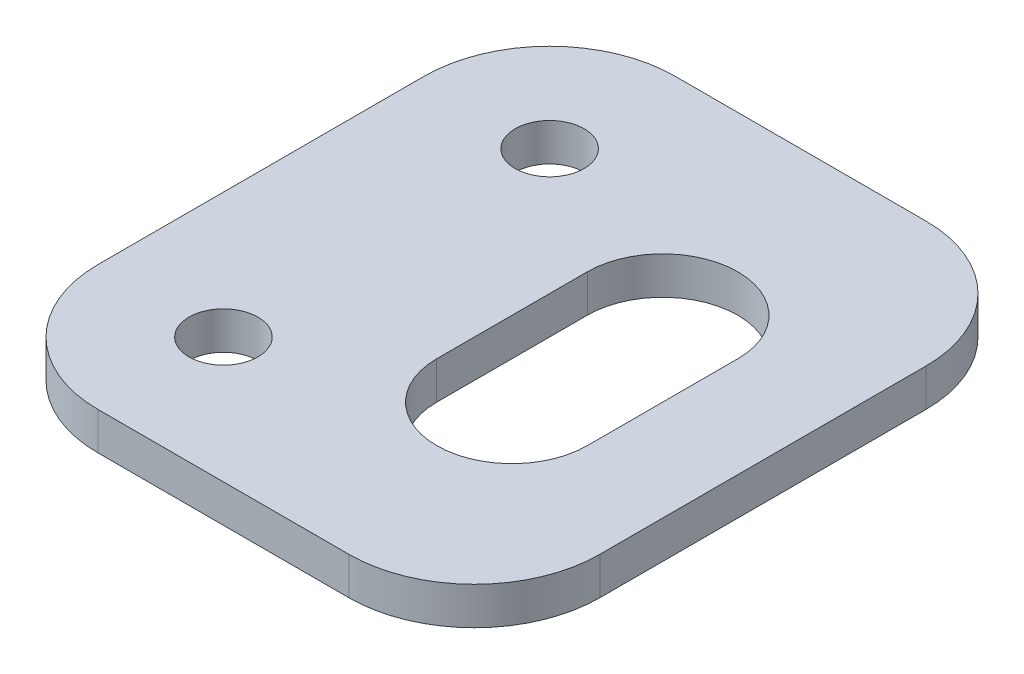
ISO-10303-21;
HEADER;
FILE_DESCRIPTION(('STEP AP214'),'2;1');
FILE_NAME('part.step','',(''),(''),'','','');
FILE_SCHEMA(('AUTOMOTIVE_DESIGN { 1 0 10303 214 1 1 1 1 }'));
ENDSEC;
DATA;
#1=APPLICATION_CONTEXT('core data for automotive mechanical design processes');
#2=APPLICATION_PROTOCOL_DEFINITION('international standard','automotive_design',2000,#1);
#3=PRODUCT_CONTEXT('',#1,'mechanical');
#4=PRODUCT('Part','Part','',(#3));
#5=PRODUCT_RELATED_PRODUCT_CATEGORY('part','',(#4));
#6=PRODUCT_DEFINITION_FORMATION('','',#4);
#7=PRODUCT_DEFINITION_CONTEXT('part definition',#1,'design');
#8=PRODUCT_DEFINITION('design','',#6,#7);
#9=PRODUCT_DEFINITION_SHAPE('','',#8);
#10=(LENGTH_UNIT() NAMED_UNIT(*) SI_UNIT(.MILLI.,.METRE.));
#11=(NAMED_UNIT(*) PLANE_ANGLE_UNIT() SI_UNIT($,.RADIAN.));
#12=(NAMED_UNIT(*) SI_UNIT($,.STERADIAN.) SOLID_ANGLE_UNIT());
#13=UNCERTAINTY_MEASURE_WITH_UNIT(LENGTH_MEASURE(1.E-05),#10,'distance_accuracy_value','');
#14=(GEOMETRIC_REPRESENTATION_CONTEXT(3) GLOBAL_UNCERTAINTY_ASSIGNED_CONTEXT((#13)) GLOBAL_UNIT_ASSIGNED_CONTEXT((#10,
#11,#12)) REPRESENTATION_CONTEXT('',''));
#15=CARTESIAN_POINT('',(0.,0.,0.));
#16=DIRECTION('',(0.,0.,1.));
#17=DIRECTION('',(1.,0.,0.));
#18=AXIS2_PLACEMENT_3D('',#15,#16,#17);
#19=CARTESIAN_POINT('',(30.,3.,-36.));
#20=DIRECTION('',(0.,1.,0.));
#21=DIRECTION('',(0.,0.,1.));
#22=AXIS2_PLACEMENT_3D('',#19,#20,#21);
#23=PLANE('',#22);
#24=CARTESIAN_POINT('',(10.,3.,-10.));
#25=DIRECTION('',(0.,1.,0.));
#26=DIRECTION('',(0.,0.,1.));
#27=AXIS2_PLACEMENT_3D('',#24,#25,#26);
#28=CIRCLE('',#27,2.75);
#29=CARTESIAN_POINT('',(10.,3.,-7.25));
#30=VERTEX_POINT('',#29);
#31=EDGE_CURVE('E156',#30,#30,#28,.T.);
#32=ORIENTED_EDGE('',*,*,#31,.F.);
#33=EDGE_LOOP('',(#32));
#34=FACE_BOUND('',#33,.T.);
#35=CARTESIAN_POINT('',(30.,3.,-36.));
#36=DIRECTION('',(0.,1.,0.));
#37=DIRECTION('',(0.,0.,1.));
#38=AXIS2_PLACEMENT_3D('',#35,#36,#37);
#39=CIRCLE('',#38,10.);
#40=CARTESIAN_POINT('',(40.,3.,-35.9999999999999));
#41=VERTEX_POINT('',#40);
#42=CARTESIAN_POINT('',(29.9999999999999,3.,-46.));
#43=VERTEX_POINT('',#42);
#44=EDGE_CURVE('E168',#41,#43,#39,.T.);
#45=ORIENTED_EDGE('',*,*,#44,.T.);
#46=DIRECTION('',(-1.,0.,0.));
#47=VECTOR('',#46,1.);
#48=CARTESIAN_POINT('',(10.0000000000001,3.,-46.));
#49=LINE('',#48,#47);
#50=CARTESIAN_POINT('',(10.0000000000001,3.,-46.));
#51=VERTEX_POINT('',#50);
#52=EDGE_CURVE('E171',#43,#51,#49,.T.);
#53=ORIENTED_EDGE('',*,*,#52,.T.);
#54=CARTESIAN_POINT('',(10.,3.,-36.));
#55=DIRECTION('',(0.,1.,0.));
#56=DIRECTION('',(0.,0.,1.));
#57=AXIS2_PLACEMENT_3D('',#54,#55,#56);
#58=CIRCLE('',#57,10.);
#59=CARTESIAN_POINT('',(0.,3.,-35.9999999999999));
#60=VERTEX_POINT('',#59);
#61=EDGE_CURVE('E174',#51,#60,#58,.T.);
#62=ORIENTED_EDGE('',*,*,#61,.T.);
#63=DIRECTION('',(0.,0.,1.));
#64=VECTOR('',#63,1.);
#65=CARTESIAN_POINT('',(0.,3.,-10.0000000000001));
#66=LINE('',#65,#64);
#67=CARTESIAN_POINT('',(0.,3.,-10.0000000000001));
#68=VERTEX_POINT('',#67);
#69=EDGE_CURVE('E176',#60,#68,#66,.T.);
#70=ORIENTED_EDGE('',*,*,#69,.T.);
#71=CARTESIAN_POINT('',(10.,3.,-10.));
#72=DIRECTION('',(0.,1.,0.));
#73=DIRECTION('',(0.,0.,1.));
#74=AXIS2_PLACEMENT_3D('',#71,#72,#73);
#75=CIRCLE('',#74,10.);
#76=CARTESIAN_POINT('',(10.0000000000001,3.,0.));
#77=VERTEX_POINT('',#76);
#78=EDGE_CURVE('E178',#68,#77,#75,.T.);
#79=ORIENTED_EDGE('',*,*,#78,.T.);
#80=DIRECTION('',(1.,0.,0.));
#81=VECTOR('',#80,1.);
#82=CARTESIAN_POINT('',(10.0000000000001,3.,0.));
#83=LINE('',#82,#81);
#84=CARTESIAN_POINT('',(29.9999999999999,3.,0.));
#85=VERTEX_POINT('',#84);
#86=EDGE_CURVE('E180',#77,#85,#83,.T.);
#87=ORIENTED_EDGE('',*,*,#86,.T.);
#88=CARTESIAN_POINT('',(30.,3.,-10.));
#89=DIRECTION('',(0.,1.,0.));
#90=DIRECTION('',(0.,0.,1.));
#91=AXIS2_PLACEMENT_3D('',#88,#89,#90);
#92=CIRCLE('',#91,10.);
#93=CARTESIAN_POINT('',(40.,3.,-10.0000000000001));
#94=VERTEX_POINT('',#93);
#95=EDGE_CURVE('E182',#85,#94,#92,.T.);
#96=ORIENTED_EDGE('',*,*,#95,.T.);
#97=DIRECTION('',(0.,0.,-1.));
#98=VECTOR('',#97,1.);
#99=CARTESIAN_POINT('',(40.,3.,-10.0000000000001));
#100=LINE('',#99,#98);
#101=EDGE_CURVE('E184',#94,#41,#100,.T.);
#102=ORIENTED_EDGE('',*,*,#101,.T.);
#103=EDGE_LOOP('',(#45,#53,#62,#70,#79,#87,#96,#102));
#104=FACE_BOUND('',#103,.T.);
#105=CARTESIAN_POINT('',(10.,3.,-36.));
#106=DIRECTION('',(0.,1.,0.));
#107=DIRECTION('',(0.,0.,1.));
#108=AXIS2_PLACEMENT_3D('',#105,#106,#107);
#109=CIRCLE('',#108,2.75);
#110=CARTESIAN_POINT('',(10.,3.,-33.25));
#111=VERTEX_POINT('',#110);
#112=EDGE_CURVE('E162',#111,#111,#109,.T.);
#113=ORIENTED_EDGE('',*,*,#112,.F.);
#114=EDGE_LOOP('',(#113));
#115=FACE_BOUND('',#114,.T.);
#116=DIRECTION('',(0.,0.,1.));
#117=VECTOR('',#116,1.);
#118=CARTESIAN_POINT('',(20.,3.,-29.));
#119=LINE('',#118,#117);
#120=CARTESIAN_POINT('',(20.,3.,-29.));
#121=VERTEX_POINT('',#120);
#122=CARTESIAN_POINT('',(20.,3.,-17.));
#123=VERTEX_POINT('',#122);
#124=EDGE_CURVE('E128',#121,#123,#119,.T.);
#125=ORIENTED_EDGE('',*,*,#124,.F.);
#126=CARTESIAN_POINT('',(26.,3.,-29.));
#127=DIRECTION('',(0.,1.,0.));
#128=DIRECTION('',(0.,0.,1.));
#129=AXIS2_PLACEMENT_3D('',#126,#127,#128);
#130=CIRCLE('',#129,6.);
#131=CARTESIAN_POINT('',(32.,3.,-29.));
#132=VERTEX_POINT('',#131);
#133=EDGE_CURVE('E120',#132,#121,#130,.T.);
#134=ORIENTED_EDGE('',*,*,#133,.F.);
#135=DIRECTION('',(0.,0.,-1.));
#136=VECTOR('',#135,1.);
#137=CARTESIAN_POINT('',(32.,3.,-29.));
#138=LINE('',#137,#136);
#139=CARTESIAN_POINT('',(32.,3.,-17.));
#140=VERTEX_POINT('',#139);
#141=EDGE_CURVE('E142',#140,#132,#138,.T.);
#142=ORIENTED_EDGE('',*,*,#141,.F.);
#143=CARTESIAN_POINT('',(26.,3.,-17.));
#144=DIRECTION('',(0.,1.,0.));
#145=DIRECTION('',(0.,0.,1.));
#146=AXIS2_PLACEMENT_3D('',#143,#144,#145);
#147=CIRCLE('',#146,6.);
#148=EDGE_CURVE('E140',#123,#140,#147,.T.);
#149=ORIENTED_EDGE('',*,*,#148,.F.);
#150=EDGE_LOOP('',(#125,#134,#142,#149));
#151=FACE_BOUND('',#150,.T.);
#152=ADVANCED_FACE('F31',(#34,#104,#115,#151),#23,.T.);
#153=CARTESIAN_POINT('',(30.,0.,-36.));
#154=DIRECTION('',(0.,1.,0.));
#155=DIRECTION('',(0.,0.,1.));
#156=AXIS2_PLACEMENT_3D('',#153,#154,#155);
#157=PLANE('',#156);
#158=CARTESIAN_POINT('',(10.,0.,-10.));
#159=DIRECTION('',(0.,1.,0.));
#160=DIRECTION('',(0.,0.,1.));
#161=AXIS2_PLACEMENT_3D('',#158,#159,#160);
#162=CIRCLE('',#161,2.75);
#163=CARTESIAN_POINT('',(10.,0.,-7.25));
#164=VERTEX_POINT('',#163);
#165=EDGE_CURVE('E136',#164,#164,#162,.T.);
#166=ORIENTED_EDGE('',*,*,#165,.T.);
#167=EDGE_LOOP('',(#166));
#168=FACE_BOUND('',#167,.T.);
#169=CARTESIAN_POINT('',(30.,0.,-36.));
#170=DIRECTION('',(0.,1.,0.));
#171=DIRECTION('',(0.,0.,1.));
#172=AXIS2_PLACEMENT_3D('',#169,#170,#171);
#173=CIRCLE('',#172,10.);
#174=CARTESIAN_POINT('',(40.,0.,-35.9999999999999));
#175=VERTEX_POINT('',#174);
#176=CARTESIAN_POINT('',(29.9999999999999,0.,-46.));
#177=VERTEX_POINT('',#176);
#178=EDGE_CURVE('E165',#175,#177,#173,.T.);
#179=ORIENTED_EDGE('',*,*,#178,.F.);
#180=DIRECTION('',(0.,0.,-1.));
#181=VECTOR('',#180,1.);
#182=CARTESIAN_POINT('',(40.,0.,-10.0000000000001));
#183=LINE('',#182,#181);
#184=CARTESIAN_POINT('',(40.,0.,-10.0000000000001));
#185=VERTEX_POINT('',#184);
#186=EDGE_CURVE('E172',#185,#175,#183,.T.);
#187=ORIENTED_EDGE('',*,*,#186,.F.);
#188=CARTESIAN_POINT('',(30.,0.,-10.));
#189=DIRECTION('',(0.,1.,0.));
#190=DIRECTION('',(0.,0.,1.));
#191=AXIS2_PLACEMENT_3D('',#188,#189,#190);
#192=CIRCLE('',#191,10.);
#193=CARTESIAN_POINT('',(29.9999999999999,0.,0.));
#194=VERTEX_POINT('',#193);
#195=EDGE_CURVE('E199',#194,#185,#192,.T.);
#196=ORIENTED_EDGE('',*,*,#195,.F.);
#197=DIRECTION('',(1.,0.,0.));
#198=VECTOR('',#197,1.);
#199=CARTESIAN_POINT('',(10.0000000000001,0.,0.));
#200=LINE('',#199,#198);
#201=CARTESIAN_POINT('',(10.0000000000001,0.,0.));
#202=VERTEX_POINT('',#201);
#203=EDGE_CURVE('E197',#202,#194,#200,.T.);
#204=ORIENTED_EDGE('',*,*,#203,.F.);
#205=CARTESIAN_POINT('',(10.,0.,-10.));
#206=DIRECTION('',(0.,1.,0.));
#207=DIRECTION('',(0.,0.,1.));
#208=AXIS2_PLACEMENT_3D('',#205,#206,#207);
#209=CIRCLE('',#208,10.);
#210=CARTESIAN_POINT('',(0.,0.,-10.0000000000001));
#211=VERTEX_POINT('',#210);
#212=EDGE_CURVE('E195',#211,#202,#209,.T.);
#213=ORIENTED_EDGE('',*,*,#212,.F.);
#214=DIRECTION('',(0.,0.,1.));
#215=VECTOR('',#214,1.);
#216=CARTESIAN_POINT('',(0.,0.,-10.0000000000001));
#217=LINE('',#216,#215);
#218=CARTESIAN_POINT('',(0.,0.,-35.9999999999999));
#219=VERTEX_POINT('',#218);
#220=EDGE_CURVE('E193',#219,#211,#217,.T.);
#221=ORIENTED_EDGE('',*,*,#220,.F.);
#222=CARTESIAN_POINT('',(10.,0.,-36.));
#223=DIRECTION('',(0.,1.,0.));
#224=DIRECTION('',(0.,0.,1.));
#225=AXIS2_PLACEMENT_3D('',#222,#223,#224);
#226=CIRCLE('',#225,10.);
#227=CARTESIAN_POINT('',(10.0000000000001,0.,-46.));
#228=VERTEX_POINT('',#227);
#229=EDGE_CURVE('E191',#228,#219,#226,.T.);
#230=ORIENTED_EDGE('',*,*,#229,.F.);
#231=DIRECTION('',(-1.,0.,0.));
#232=VECTOR('',#231,1.);
#233=CARTESIAN_POINT('',(10.0000000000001,0.,-46.));
#234=LINE('',#233,#232);
#235=EDGE_CURVE('E189',#177,#228,#234,.T.);
#236=ORIENTED_EDGE('',*,*,#235,.F.);
#237=EDGE_LOOP('',(#179,#187,#196,#204,#213,#221,#230,#236));
#238=FACE_BOUND('',#237,.T.);
#239=CARTESIAN_POINT('',(10.,0.,-36.));
#240=DIRECTION('',(0.,1.,0.));
#241=DIRECTION('',(0.,0.,1.));
#242=AXIS2_PLACEMENT_3D('',#239,#240,#241);
#243=CIRCLE('',#242,2.75);
#244=CARTESIAN_POINT('',(10.,0.,-33.25));
#245=VERTEX_POINT('',#244);
#246=EDGE_CURVE('E159',#245,#245,#243,.T.);
#247=ORIENTED_EDGE('',*,*,#246,.T.);
#248=EDGE_LOOP('',(#247));
#249=FACE_BOUND('',#248,.T.);
#250=CARTESIAN_POINT('',(26.,0.,-29.));
#251=DIRECTION('',(0.,1.,0.));
#252=DIRECTION('',(0.,0.,1.));
#253=AXIS2_PLACEMENT_3D('',#250,#251,#252);
#254=CIRCLE('',#253,6.);
#255=CARTESIAN_POINT('',(32.,0.,-29.));
#256=VERTEX_POINT('',#255);
#257=CARTESIAN_POINT('',(20.,0.,-29.));
#258=VERTEX_POINT('',#257);
#259=EDGE_CURVE('E54',#256,#258,#254,.T.);
#260=ORIENTED_EDGE('',*,*,#259,.T.);
#261=DIRECTION('',(0.,0.,1.));
#262=VECTOR('',#261,1.);
#263=CARTESIAN_POINT('',(20.,0.,-29.));
#264=LINE('',#263,#262);
#265=CARTESIAN_POINT('',(20.,0.,-17.));
#266=VERTEX_POINT('',#265);
#267=EDGE_CURVE('E135',#258,#266,#264,.T.);
#268=ORIENTED_EDGE('',*,*,#267,.T.);
#269=CARTESIAN_POINT('',(26.,0.,-17.));
#270=DIRECTION('',(0.,1.,0.));
#271=DIRECTION('',(0.,0.,1.));
#272=AXIS2_PLACEMENT_3D('',#269,#270,#271);
#273=CIRCLE('',#272,6.);
#274=CARTESIAN_POINT('',(32.,0.,-17.));
#275=VERTEX_POINT('',#274);
#276=EDGE_CURVE('E148',#266,#275,#273,.T.);
#277=ORIENTED_EDGE('',*,*,#276,.T.);
#278=DIRECTION('',(0.,0.,-1.));
#279=VECTOR('',#278,1.);
#280=CARTESIAN_POINT('',(32.,0.,-29.));
#281=LINE('',#280,#279);
#282=EDGE_CURVE('E129',#275,#256,#281,.T.);
#283=ORIENTED_EDGE('',*,*,#282,.T.);
#284=EDGE_LOOP('',(#260,#268,#277,#283));
#285=FACE_BOUND('',#284,.T.);
#286=ADVANCED_FACE('F229',(#168,#238,#249,#285),#157,.F.);
#287=CARTESIAN_POINT('',(30.,3.,-36.));
#288=DIRECTION('',(0.,-1.,0.));
#289=DIRECTION('',(0.,0.,-1.));
#290=AXIS2_PLACEMENT_3D('',#287,#288,#289);
#291=CYLINDRICAL_SURFACE('',#290,10.);
#292=ORIENTED_EDGE('',*,*,#178,.T.);
#293=DIRECTION('',(0.,-1.,0.));
#294=VECTOR('',#293,1.);
#295=CARTESIAN_POINT('',(29.9999999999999,3.,-46.));
#296=LINE('',#295,#294);
#297=EDGE_CURVE('E11',#43,#177,#296,.T.);
#298=ORIENTED_EDGE('',*,*,#297,.F.);
#299=ORIENTED_EDGE('',*,*,#44,.F.);
#300=DIRECTION('',(0.,-1.,0.));
#301=VECTOR('',#300,1.);
#302=CARTESIAN_POINT('',(40.,3.,-35.9999999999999));
#303=LINE('',#302,#301);
#304=EDGE_CURVE('E186',#41,#175,#303,.T.);
#305=ORIENTED_EDGE('',*,*,#304,.T.);
#306=EDGE_LOOP('',(#292,#298,#299,#305));
#307=FACE_BOUND('',#306,.T.);
#308=ADVANCED_FACE('F33',(#307),#291,.T.);
#309=CARTESIAN_POINT('',(10.0000000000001,3.,-46.));
#310=DIRECTION('',(0.,0.,1.));
#311=DIRECTION('',(1.,0.,0.));
#312=AXIS2_PLACEMENT_3D('',#309,#310,#311);
#313=PLANE('',#312);
#314=ORIENTED_EDGE('',*,*,#235,.T.);
#315=DIRECTION('',(0.,-1.,0.));
#316=VECTOR('',#315,1.);
#317=CARTESIAN_POINT('',(10.0000000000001,3.,-46.));
#318=LINE('',#317,#316);
#319=EDGE_CURVE('E39',#51,#228,#318,.T.);
#320=ORIENTED_EDGE('',*,*,#319,.F.);
#321=ORIENTED_EDGE('',*,*,#52,.F.);
#322=ORIENTED_EDGE('',*,*,#297,.T.);
#323=EDGE_LOOP('',(#314,#320,#321,#322));
#324=FACE_BOUND('',#323,.T.);
#325=ADVANCED_FACE('F247',(#324),#313,.F.);
#326=CARTESIAN_POINT('',(10.,3.,-36.));
#327=DIRECTION('',(0.,-1.,0.));
#328=DIRECTION('',(0.,0.,-1.));
#329=AXIS2_PLACEMENT_3D('',#326,#327,#328);
#330=CYLINDRICAL_SURFACE('',#329,10.);
#331=ORIENTED_EDGE('',*,*,#229,.T.);
#332=DIRECTION('',(0.,-1.,0.));
#333=VECTOR('',#332,1.);
#334=CARTESIAN_POINT('',(0.,3.,-35.9999999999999));
#335=LINE('',#334,#333);
#336=EDGE_CURVE('E216',#60,#219,#335,.T.);
#337=ORIENTED_EDGE('',*,*,#336,.F.);
#338=ORIENTED_EDGE('',*,*,#61,.F.);
#339=ORIENTED_EDGE('',*,*,#319,.T.);
#340=EDGE_LOOP('',(#331,#337,#338,#339));
#341=FACE_BOUND('',#340,.T.);
#342=ADVANCED_FACE('F223',(#341),#330,.T.);
#343=CARTESIAN_POINT('',(0.,3.,-10.0000000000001));
#344=DIRECTION('',(1.,0.,0.));
#345=DIRECTION('',(0.,0.,-1.));
#346=AXIS2_PLACEMENT_3D('',#343,#344,#345);
#347=PLANE('',#346);
#348=ORIENTED_EDGE('',*,*,#220,.T.);
#349=DIRECTION('',(0.,-1.,0.));
#350=VECTOR('',#349,1.);
#351=CARTESIAN_POINT('',(0.,3.,-10.0000000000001));
#352=LINE('',#351,#350);
#353=EDGE_CURVE('E213',#68,#211,#352,.T.);
#354=ORIENTED_EDGE('',*,*,#353,.F.);
#355=ORIENTED_EDGE('',*,*,#69,.F.);
#356=ORIENTED_EDGE('',*,*,#336,.T.);
#357=EDGE_LOOP('',(#348,#354,#355,#356));
#358=FACE_BOUND('',#357,.T.);
#359=ADVANCED_FACE('F235',(#358),#347,.F.);
#360=CARTESIAN_POINT('',(10.,3.,-10.));
#361=DIRECTION('',(0.,-1.,0.));
#362=DIRECTION('',(0.,0.,-1.));
#363=AXIS2_PLACEMENT_3D('',#360,#361,#362);
#364=CYLINDRICAL_SURFACE('',#363,10.);
#365=ORIENTED_EDGE('',*,*,#212,.T.);
#366=DIRECTION('',(0.,-1.,0.));
#367=VECTOR('',#366,1.);
#368=CARTESIAN_POINT('',(10.0000000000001,3.,0.));
#369=LINE('',#368,#367);
#370=EDGE_CURVE('E210',#77,#202,#369,.T.);
#371=ORIENTED_EDGE('',*,*,#370,.F.);
#372=ORIENTED_EDGE('',*,*,#78,.F.);
#373=ORIENTED_EDGE('',*,*,#353,.T.);
#374=EDGE_LOOP('',(#365,#371,#372,#373));
#375=FACE_BOUND('',#374,.T.);
#376=ADVANCED_FACE('F239',(#375),#364,.T.);
#377=CARTESIAN_POINT('',(10.0000000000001,3.,0.));
#378=DIRECTION('',(0.,0.,-1.));
#379=DIRECTION('',(-1.,0.,0.));
#380=AXIS2_PLACEMENT_3D('',#377,#378,#379);
#381=PLANE('',#380);
#382=ORIENTED_EDGE('',*,*,#203,.T.);
#383=DIRECTION('',(0.,-1.,0.));
#384=VECTOR('',#383,1.);
#385=CARTESIAN_POINT('',(29.9999999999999,3.,0.));
#386=LINE('',#385,#384);
#387=EDGE_CURVE('E207',#85,#194,#386,.T.);
#388=ORIENTED_EDGE('',*,*,#387,.F.);
#389=ORIENTED_EDGE('',*,*,#86,.F.);
#390=ORIENTED_EDGE('',*,*,#370,.T.);
#391=EDGE_LOOP('',(#382,#388,#389,#390));
#392=FACE_BOUND('',#391,.T.);
#393=ADVANCED_FACE('F260',(#392),#381,.F.);
#394=CARTESIAN_POINT('',(30.,3.,-10.));
#395=DIRECTION('',(0.,-1.,0.));
#396=DIRECTION('',(0.,0.,-1.));
#397=AXIS2_PLACEMENT_3D('',#394,#395,#396);
#398=CYLINDRICAL_SURFACE('',#397,10.);
#399=ORIENTED_EDGE('',*,*,#195,.T.);
#400=DIRECTION('',(0.,-1.,0.));
#401=VECTOR('',#400,1.);
#402=CARTESIAN_POINT('',(40.,3.,-10.0000000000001));
#403=LINE('',#402,#401);
#404=EDGE_CURVE('E204',#94,#185,#403,.T.);
#405=ORIENTED_EDGE('',*,*,#404,.F.);
#406=ORIENTED_EDGE('',*,*,#95,.F.);
#407=ORIENTED_EDGE('',*,*,#387,.T.);
#408=EDGE_LOOP('',(#399,#405,#406,#407));
#409=FACE_BOUND('',#408,.T.);
#410=ADVANCED_FACE('F258',(#409),#398,.T.);
#411=CARTESIAN_POINT('',(40.,3.,-10.0000000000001));
#412=DIRECTION('',(-1.,0.,0.));
#413=DIRECTION('',(0.,0.,1.));
#414=AXIS2_PLACEMENT_3D('',#411,#412,#413);
#415=PLANE('',#414);
#416=ORIENTED_EDGE('',*,*,#186,.T.);
#417=ORIENTED_EDGE('',*,*,#304,.F.);
#418=ORIENTED_EDGE('',*,*,#101,.F.);
#419=ORIENTED_EDGE('',*,*,#404,.T.);
#420=EDGE_LOOP('',(#416,#417,#418,#419));
#421=FACE_BOUND('',#420,.T.);
#422=ADVANCED_FACE('F253',(#421),#415,.F.);
#423=CARTESIAN_POINT('',(10.,3.,-36.));
#424=DIRECTION('',(0.,-1.,0.));
#425=DIRECTION('',(0.,0.,-1.));
#426=AXIS2_PLACEMENT_3D('',#423,#424,#425);
#427=CYLINDRICAL_SURFACE('',#426,2.75);
#428=ORIENTED_EDGE('',*,*,#112,.T.);
#429=EDGE_LOOP('',(#428));
#430=FACE_BOUND('',#429,.T.);
#431=ORIENTED_EDGE('',*,*,#246,.F.);
#432=EDGE_LOOP('',(#431));
#433=FACE_BOUND('',#432,.T.);
#434=ADVANCED_FACE('F279',(#430,#433),#427,.F.);
#435=CARTESIAN_POINT('',(10.,3.,-10.));
#436=DIRECTION('',(0.,-1.,0.));
#437=DIRECTION('',(0.,0.,-1.));
#438=AXIS2_PLACEMENT_3D('',#435,#436,#437);
#439=CYLINDRICAL_SURFACE('',#438,2.75);
#440=ORIENTED_EDGE('',*,*,#31,.T.);
#441=EDGE_LOOP('',(#440));
#442=FACE_BOUND('',#441,.T.);
#443=ORIENTED_EDGE('',*,*,#165,.F.);
#444=EDGE_LOOP('',(#443));
#445=FACE_BOUND('',#444,.T.);
#446=ADVANCED_FACE('F286',(#442,#445),#439,.F.);
#447=CARTESIAN_POINT('',(26.,3.,-29.));
#448=DIRECTION('',(0.,-1.,0.));
#449=DIRECTION('',(0.,0.,-1.));
#450=AXIS2_PLACEMENT_3D('',#447,#448,#449);
#451=CYLINDRICAL_SURFACE('',#450,6.);
#452=ORIENTED_EDGE('',*,*,#259,.F.);
#453=DIRECTION('',(0.,-1.,0.));
#454=VECTOR('',#453,1.);
#455=CARTESIAN_POINT('',(32.,3.,-29.));
#456=LINE('',#455,#454);
#457=EDGE_CURVE('E124',#132,#256,#456,.T.);
#458=ORIENTED_EDGE('',*,*,#457,.F.);
#459=ORIENTED_EDGE('',*,*,#133,.T.);
#460=DIRECTION('',(0.,-1.,0.));
#461=VECTOR('',#460,1.);
#462=CARTESIAN_POINT('',(20.,3.,-29.));
#463=LINE('',#462,#461);
#464=EDGE_CURVE('E123',#121,#258,#463,.T.);
#465=ORIENTED_EDGE('',*,*,#464,.T.);
#466=EDGE_LOOP('',(#452,#458,#459,#465));
#467=FACE_BOUND('',#466,.T.);
#468=ADVANCED_FACE('F122',(#467),#451,.F.);
#469=CARTESIAN_POINT('',(20.,3.,-29.));
#470=DIRECTION('',(1.,0.,0.));
#471=DIRECTION('',(0.,0.,-1.));
#472=AXIS2_PLACEMENT_3D('',#469,#470,#471);
#473=PLANE('',#472);
#474=ORIENTED_EDGE('',*,*,#267,.F.);
#475=ORIENTED_EDGE('',*,*,#464,.F.);
#476=ORIENTED_EDGE('',*,*,#124,.T.);
#477=DIRECTION('',(0.,-1.,0.));
#478=VECTOR('',#477,1.);
#479=CARTESIAN_POINT('',(20.,3.,-17.));
#480=LINE('',#479,#478);
#481=EDGE_CURVE('E137',#123,#266,#480,.T.);
#482=ORIENTED_EDGE('',*,*,#481,.T.);
#483=EDGE_LOOP('',(#474,#475,#476,#482));
#484=FACE_BOUND('',#483,.T.);
#485=ADVANCED_FACE('F132',(#484),#473,.T.);
#486=CARTESIAN_POINT('',(26.,3.,-17.));
#487=DIRECTION('',(0.,-1.,0.));
#488=DIRECTION('',(0.,0.,-1.));
#489=AXIS2_PLACEMENT_3D('',#486,#487,#488);
#490=CYLINDRICAL_SURFACE('',#489,6.);
#491=ORIENTED_EDGE('',*,*,#276,.F.);
#492=ORIENTED_EDGE('',*,*,#481,.F.);
#493=ORIENTED_EDGE('',*,*,#148,.T.);
#494=DIRECTION('',(0.,-1.,0.));
#495=VECTOR('',#494,1.);
#496=CARTESIAN_POINT('',(32.,3.,-17.));
#497=LINE('',#496,#495);
#498=EDGE_CURVE('E46',#140,#275,#497,.T.);
#499=ORIENTED_EDGE('',*,*,#498,.T.);
#500=EDGE_LOOP('',(#491,#492,#493,#499));
#501=FACE_BOUND('',#500,.T.);
#502=ADVANCED_FACE('F299',(#501),#490,.F.);
#503=CARTESIAN_POINT('',(32.,3.,-29.));
#504=DIRECTION('',(-1.,0.,0.));
#505=DIRECTION('',(0.,0.,1.));
#506=AXIS2_PLACEMENT_3D('',#503,#504,#505);
#507=PLANE('',#506);
#508=ORIENTED_EDGE('',*,*,#282,.F.);
#509=ORIENTED_EDGE('',*,*,#498,.F.);
#510=ORIENTED_EDGE('',*,*,#141,.T.);
#511=ORIENTED_EDGE('',*,*,#457,.T.);
#512=EDGE_LOOP('',(#508,#509,#510,#511));
#513=FACE_BOUND('',#512,.T.);
#514=ADVANCED_FACE('F297',(#513),#507,.T.);
#515=CLOSED_SHELL('',(#152,#286,#308,#325,#342,#359,#376,#393,#410,#422,#434,#446,#468,#485,
#502,#514));
#516=MANIFOLD_SOLID_BREP('B2',#515);
#517=ADVANCED_BREP_SHAPE_REPRESENTATION('',(#18,#516),#14);
#518=SHAPE_DEFINITION_REPRESENTATION(#9,#517);
ENDSEC;
END-ISO-10303-21;
